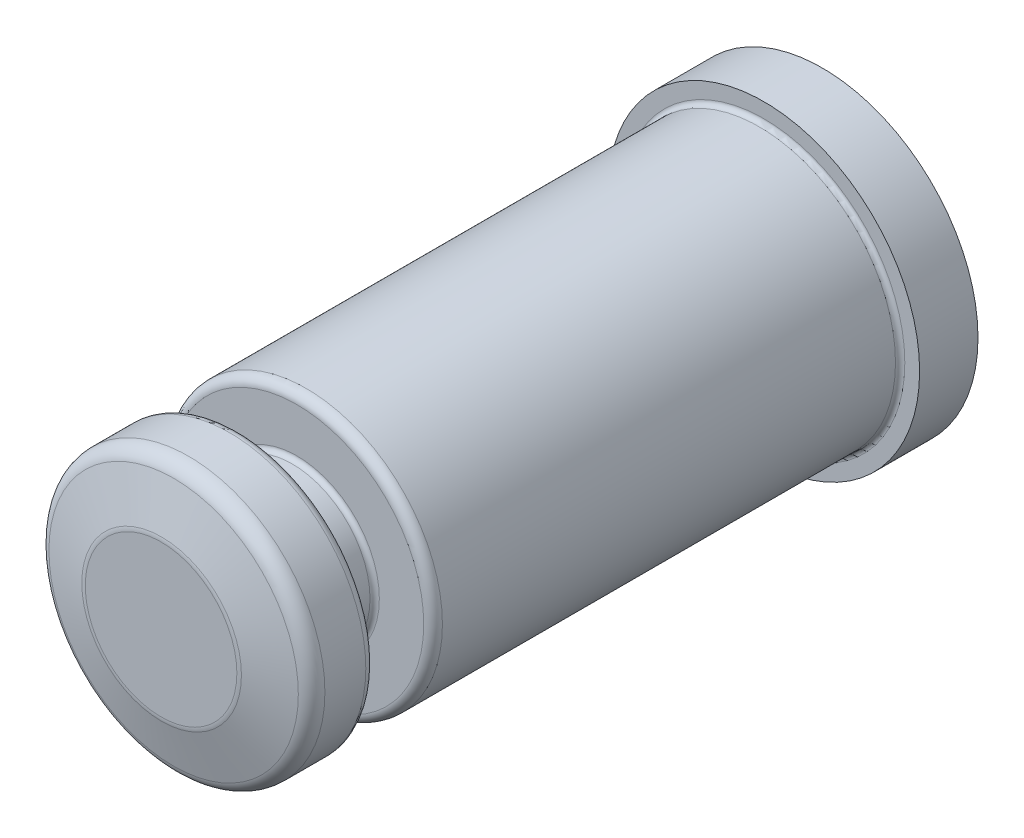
ISO-10303-21;
HEADER;
FILE_DESCRIPTION(('STEP AP214'),'2;1');
FILE_NAME('part.step','',(''),(''),'','','');
FILE_SCHEMA(('AUTOMOTIVE_DESIGN { 1 0 10303 214 1 1 1 1 }'));
ENDSEC;
DATA;
#1=APPLICATION_CONTEXT('core data for automotive mechanical design processes');
#2=APPLICATION_PROTOCOL_DEFINITION('international standard','automotive_design',2000,#1);
#3=PRODUCT_CONTEXT('',#1,'mechanical');
#4=PRODUCT('Part','Part','',(#3));
#5=PRODUCT_RELATED_PRODUCT_CATEGORY('part','',(#4));
#6=PRODUCT_DEFINITION_FORMATION('','',#4);
#7=PRODUCT_DEFINITION_CONTEXT('part definition',#1,'design');
#8=PRODUCT_DEFINITION('design','',#6,#7);
#9=PRODUCT_DEFINITION_SHAPE('','',#8);
#10=(LENGTH_UNIT() NAMED_UNIT(*) SI_UNIT(.MILLI.,.METRE.));
#11=(NAMED_UNIT(*) PLANE_ANGLE_UNIT() SI_UNIT($,.RADIAN.));
#12=(NAMED_UNIT(*) SI_UNIT($,.STERADIAN.) SOLID_ANGLE_UNIT());
#13=UNCERTAINTY_MEASURE_WITH_UNIT(LENGTH_MEASURE(1.E-05),#10,'distance_accuracy_value','');
#14=(GEOMETRIC_REPRESENTATION_CONTEXT(3) GLOBAL_UNCERTAINTY_ASSIGNED_CONTEXT((#13)) GLOBAL_UNIT_ASSIGNED_CONTEXT((#10,
#11,#12)) REPRESENTATION_CONTEXT('',''));
#15=CARTESIAN_POINT('',(0.,0.,0.));
#16=DIRECTION('',(0.,0.,1.));
#17=DIRECTION('',(1.,0.,0.));
#18=AXIS2_PLACEMENT_3D('',#15,#16,#17);
#19=CARTESIAN_POINT('',(0.,0.,-42.8624999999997));
#20=DIRECTION('',(0.,0.,-0.999999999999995));
#21=DIRECTION('',(-1.,0.,0.));
#22=AXIS2_PLACEMENT_3D('',#19,#20,#21);
#23=PLANE('',#22);
#24=CARTESIAN_POINT('',(0.,0.,-42.8624999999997));
#25=DIRECTION('',(0.,0.,0.999999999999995));
#26=DIRECTION('',(1.,0.,0.));
#27=AXIS2_PLACEMENT_3D('',#24,#25,#26);
#28=CIRCLE('',#27,12.7);
#29=CARTESIAN_POINT('',(12.7,0.,-42.8624999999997));
#30=VERTEX_POINT('',#29);
#31=EDGE_CURVE('E10',#30,#30,#28,.T.);
#32=ORIENTED_EDGE('',*,*,#31,.F.);
#33=EDGE_LOOP('',(#32));
#34=FACE_BOUND('',#33,.T.);
#35=ADVANCED_FACE('F39',(#34),#23,.T.);
#36=CARTESIAN_POINT('',(0.,0.,16.2761575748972));
#37=DIRECTION('',(0.,0.,0.999999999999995));
#38=DIRECTION('',(1.,0.,0.));
#39=AXIS2_PLACEMENT_3D('',#36,#37,#38);
#40=CYLINDRICAL_SURFACE('',#39,12.7);
#41=CARTESIAN_POINT('',(0.,0.,-38.0999999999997));
#42=DIRECTION('',(0.,0.,0.999999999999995));
#43=DIRECTION('',(1.,0.,0.));
#44=AXIS2_PLACEMENT_3D('',#41,#42,#43);
#45=CIRCLE('',#44,12.7);
#46=CARTESIAN_POINT('',(12.7,0.,-38.0999999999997));
#47=VERTEX_POINT('',#46);
#48=EDGE_CURVE('E46',#47,#47,#45,.T.);
#49=CARTESIAN_POINT('',(12.7,0.,-42.8624999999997));
#50=CARTESIAN_POINT('',(12.7,0.,-42.8128906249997));
#51=CARTESIAN_POINT('',(12.7,0.,-42.7632812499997));
#52=CARTESIAN_POINT('',(12.7,0.,-42.6640624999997));
#53=CARTESIAN_POINT('',(12.7,0.,-42.6144531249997));
#54=CARTESIAN_POINT('',(12.7,0.,-42.5152343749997));
#55=CARTESIAN_POINT('',(12.7,0.,-42.4656249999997));
#56=CARTESIAN_POINT('',(12.7,0.,-42.3664062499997));
#57=CARTESIAN_POINT('',(12.7,0.,-42.3167968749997));
#58=CARTESIAN_POINT('',(12.7,0.,-42.2175781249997));
#59=CARTESIAN_POINT('',(12.7,0.,-42.1679687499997));
#60=CARTESIAN_POINT('',(12.7,0.,-42.0687499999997));
#61=CARTESIAN_POINT('',(12.7,0.,-42.0191406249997));
#62=CARTESIAN_POINT('',(12.7,0.,-41.9199218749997));
#63=CARTESIAN_POINT('',(12.7,0.,-41.8703124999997));
#64=CARTESIAN_POINT('',(12.7,0.,-41.7710937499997));
#65=CARTESIAN_POINT('',(12.7,0.,-41.7214843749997));
#66=CARTESIAN_POINT('',(12.7,0.,-41.6222656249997));
#67=CARTESIAN_POINT('',(12.7,0.,-41.5726562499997));
#68=CARTESIAN_POINT('',(12.7,0.,-41.4734374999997));
#69=CARTESIAN_POINT('',(12.7,0.,-41.4238281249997));
#70=CARTESIAN_POINT('',(12.7,0.,-41.3246093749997));
#71=CARTESIAN_POINT('',(12.7,0.,-41.2749999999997));
#72=CARTESIAN_POINT('',(12.7,0.,-41.1757812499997));
#73=CARTESIAN_POINT('',(12.7,0.,-41.1261718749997));
#74=CARTESIAN_POINT('',(12.7,0.,-41.0269531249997));
#75=CARTESIAN_POINT('',(12.7,0.,-40.9773437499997));
#76=CARTESIAN_POINT('',(12.7,0.,-40.8781249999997));
#77=CARTESIAN_POINT('',(12.7,0.,-40.8285156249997));
#78=CARTESIAN_POINT('',(12.7,0.,-40.7292968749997));
#79=CARTESIAN_POINT('',(12.7,0.,-40.6796874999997));
#80=CARTESIAN_POINT('',(12.7,0.,-40.5804687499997));
#81=CARTESIAN_POINT('',(12.7,0.,-40.5308593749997));
#82=CARTESIAN_POINT('',(12.7,0.,-40.4316406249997));
#83=CARTESIAN_POINT('',(12.7,0.,-40.3820312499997));
#84=CARTESIAN_POINT('',(12.7,0.,-40.2828124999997));
#85=CARTESIAN_POINT('',(12.7,0.,-40.2332031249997));
#86=CARTESIAN_POINT('',(12.7,0.,-40.1339843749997));
#87=CARTESIAN_POINT('',(12.7,0.,-40.0843749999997));
#88=CARTESIAN_POINT('',(12.7,0.,-39.9851562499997));
#89=CARTESIAN_POINT('',(12.7,0.,-39.9355468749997));
#90=CARTESIAN_POINT('',(12.7,0.,-39.8363281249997));
#91=CARTESIAN_POINT('',(12.7,0.,-39.7867187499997));
#92=CARTESIAN_POINT('',(12.7,0.,-39.6874999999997));
#93=CARTESIAN_POINT('',(12.7,0.,-39.6378906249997));
#94=CARTESIAN_POINT('',(12.7,0.,-39.5386718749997));
#95=CARTESIAN_POINT('',(12.7,0.,-39.4890624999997));
#96=CARTESIAN_POINT('',(12.7,0.,-39.3898437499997));
#97=CARTESIAN_POINT('',(12.7,0.,-39.3402343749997));
#98=CARTESIAN_POINT('',(12.7,0.,-39.2410156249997));
#99=CARTESIAN_POINT('',(12.7,0.,-39.1914062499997));
#100=CARTESIAN_POINT('',(12.7,0.,-39.0921874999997));
#101=CARTESIAN_POINT('',(12.7,0.,-39.0425781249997));
#102=CARTESIAN_POINT('',(12.7,0.,-38.9433593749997));
#103=CARTESIAN_POINT('',(12.7,0.,-38.8937499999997));
#104=CARTESIAN_POINT('',(12.7,0.,-38.7945312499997));
#105=CARTESIAN_POINT('',(12.7,0.,-38.7449218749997));
#106=CARTESIAN_POINT('',(12.7,0.,-38.6457031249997));
#107=CARTESIAN_POINT('',(12.7,0.,-38.5960937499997));
#108=CARTESIAN_POINT('',(12.7,0.,-38.4968749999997));
#109=CARTESIAN_POINT('',(12.7,0.,-38.4472656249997));
#110=CARTESIAN_POINT('',(12.7,0.,-38.3480468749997));
#111=CARTESIAN_POINT('',(12.7,0.,-38.2984374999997));
#112=CARTESIAN_POINT('',(12.7,0.,-38.1992187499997));
#113=CARTESIAN_POINT('',(12.7,0.,-38.1496093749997));
#114=CARTESIAN_POINT('',(12.7,0.,-38.0999999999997));
#115=B_SPLINE_CURVE_WITH_KNOTS('',3,(#49,#50,#51,#52,#53,#54,#55,#56,#57,#58,#59,#60,#61,#62,
#63,#64,#65,#66,#67,#68,#69,#70,#71,#72,#73,#74,#75,#76,#77,#78,#79,#80,#81,#82,#83,#84,#85,#86,
#87,#88,#89,#90,#91,#92,#93,#94,#95,#96,#97,#98,#99,#100,#101,#102,#103,#104,#105,#106,#107,
#108,#109,#110,#111,#112,#113,#114),.UNSPECIFIED.,.F.,.F.,(4,2,2,2,2,2,2,2,2,2,2,2,2,2,2,2,2,2,
2,2,2,2,2,2,2,2,2,2,2,2,2,2,4),(0.,0.148828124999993,0.297656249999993,0.446484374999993,
0.595312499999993,0.744140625,0.892968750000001,1.041796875,1.190625,1.339453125,
1.48828124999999,1.63710937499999,1.7859375,1.934765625,2.08359375,2.232421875,2.38125,
2.530078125,2.67890625,2.82773437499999,2.97656249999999,3.125390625,3.27421875,3.423046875,
3.571875,3.720703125,3.86953125,4.018359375,4.1671875,4.316015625,4.46484375,4.613671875,
4.7625),.UNSPECIFIED.);
#116=EDGE_CURVE('BSEAM130',#30,#47,#115,.T.);
#117=ORIENTED_EDGE('',*,*,#31,.T.);
#118=ORIENTED_EDGE('',*,*,#48,.F.);
#119=ORIENTED_EDGE('',*,*,#116,.T.);
#120=ORIENTED_EDGE('',*,*,#116,.F.);
#121=EDGE_LOOP('',(#117,#119,#118,#120));
#122=FACE_BOUND('',#121,.T.);
#123=ADVANCED_FACE('F130',(#122),#40,.T.);
#124=CARTESIAN_POINT('',(-12.6999999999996,0.,-38.0999999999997));
#125=DIRECTION('',(0.,0.,0.999999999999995));
#126=DIRECTION('',(1.,0.,0.));
#127=AXIS2_PLACEMENT_3D('',#124,#125,#126);
#128=PLANE('',#127);
#129=ORIENTED_EDGE('',*,*,#48,.T.);
#130=EDGE_LOOP('',(#129));
#131=FACE_BOUND('',#130,.T.);
#132=CARTESIAN_POINT('',(0.,0.,-38.0999999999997));
#133=DIRECTION('',(0.,0.,0.999999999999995));
#134=DIRECTION('',(1.,0.,0.));
#135=AXIS2_PLACEMENT_3D('',#132,#133,#134);
#136=CIRCLE('',#135,11.4935);
#137=CARTESIAN_POINT('',(11.4935,0.,-38.0999999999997));
#138=VERTEX_POINT('',#137);
#139=EDGE_CURVE('E52',#138,#138,#136,.T.);
#140=ORIENTED_EDGE('',*,*,#139,.F.);
#141=EDGE_LOOP('',(#140));
#142=FACE_BOUND('',#141,.T.);
#143=ADVANCED_FACE('F135',(#131,#142),#128,.T.);
#144=CARTESIAN_POINT('',(0.,0.,-37.7189999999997));
#145=DIRECTION('',(0.,0.,0.999999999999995));
#146=DIRECTION('',(1.,0.,0.));
#147=AXIS2_PLACEMENT_3D('',#144,#145,#146);
#148=TOROIDAL_SURFACE('',#147,11.4935,0.380999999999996);
#149=ORIENTED_EDGE('',*,*,#139,.T.);
#150=EDGE_LOOP('',(#149));
#151=FACE_BOUND('',#150,.T.);
#152=CARTESIAN_POINT('',(0.,0.,-37.7189999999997));
#153=DIRECTION('',(0.,0.,0.999999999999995));
#154=DIRECTION('',(1.,0.,0.));
#155=AXIS2_PLACEMENT_3D('',#152,#153,#154);
#156=CIRCLE('',#155,11.1125);
#157=CARTESIAN_POINT('',(11.1125,0.,-37.7189999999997));
#158=VERTEX_POINT('',#157);
#159=EDGE_CURVE('E58',#158,#158,#156,.T.);
#160=ORIENTED_EDGE('',*,*,#159,.F.);
#161=EDGE_LOOP('',(#160));
#162=FACE_BOUND('',#161,.T.);
#163=ADVANCED_FACE('F139',(#151,#162),#148,.F.);
#164=CARTESIAN_POINT('',(0.,0.,16.2761575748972));
#165=DIRECTION('',(0.,0.,0.999999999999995));
#166=DIRECTION('',(1.,0.,0.));
#167=AXIS2_PLACEMENT_3D('',#164,#165,#166);
#168=CYLINDRICAL_SURFACE('',#167,11.1125);
#169=CARTESIAN_POINT('',(0.,0.,-0.761999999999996));
#170=DIRECTION('',(0.,0.,0.999999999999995));
#171=DIRECTION('',(1.,0.,0.));
#172=AXIS2_PLACEMENT_3D('',#169,#170,#171);
#173=CIRCLE('',#172,11.1125);
#174=CARTESIAN_POINT('',(11.1125,0.,-0.761999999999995));
#175=VERTEX_POINT('',#174);
#176=EDGE_CURVE('E64',#175,#175,#173,.T.);
#177=CARTESIAN_POINT('',(11.1125,0.,-37.7189999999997));
#178=CARTESIAN_POINT('',(11.1125,0.,-37.3340312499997));
#179=CARTESIAN_POINT('',(11.1125,0.,-36.9490624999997));
#180=CARTESIAN_POINT('',(11.1125,0.,-36.1791249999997));
#181=CARTESIAN_POINT('',(11.1125,0.,-35.7941562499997));
#182=CARTESIAN_POINT('',(11.1125,0.,-35.0242187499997));
#183=CARTESIAN_POINT('',(11.1125,0.,-34.6392499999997));
#184=CARTESIAN_POINT('',(11.1125,0.,-33.8693124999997));
#185=CARTESIAN_POINT('',(11.1125,0.,-33.4843437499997));
#186=CARTESIAN_POINT('',(11.1125,0.,-32.7144062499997));
#187=CARTESIAN_POINT('',(11.1125,0.,-32.3294374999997));
#188=CARTESIAN_POINT('',(11.1125,0.,-31.5594999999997));
#189=CARTESIAN_POINT('',(11.1125,0.,-31.1745312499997));
#190=CARTESIAN_POINT('',(11.1125,0.,-30.4045937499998));
#191=CARTESIAN_POINT('',(11.1125,0.,-30.0196249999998));
#192=CARTESIAN_POINT('',(11.1125,0.,-29.2496874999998));
#193=CARTESIAN_POINT('',(11.1125,0.,-28.8647187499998));
#194=CARTESIAN_POINT('',(11.1125,0.,-28.0947812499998));
#195=CARTESIAN_POINT('',(11.1125,0.,-27.7098124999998));
#196=CARTESIAN_POINT('',(11.1125,0.,-26.9398749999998));
#197=CARTESIAN_POINT('',(11.1125,0.,-26.5549062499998));
#198=CARTESIAN_POINT('',(11.1125,0.,-25.7849687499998));
#199=CARTESIAN_POINT('',(11.1125,0.,-25.3999999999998));
#200=CARTESIAN_POINT('',(11.1125,0.,-24.6300624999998));
#201=CARTESIAN_POINT('',(11.1125,0.,-24.2450937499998));
#202=CARTESIAN_POINT('',(11.1125,0.,-23.4751562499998));
#203=CARTESIAN_POINT('',(11.1125,0.,-23.0901874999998));
#204=CARTESIAN_POINT('',(11.1125,0.,-22.3202499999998));
#205=CARTESIAN_POINT('',(11.1125,0.,-21.9352812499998));
#206=CARTESIAN_POINT('',(11.1125,0.,-21.1653437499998));
#207=CARTESIAN_POINT('',(11.1125,0.,-20.7803749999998));
#208=CARTESIAN_POINT('',(11.1125,0.,-20.0104374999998));
#209=CARTESIAN_POINT('',(11.1125,0.,-19.6254687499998));
#210=CARTESIAN_POINT('',(11.1125,0.,-18.8555312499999));
#211=CARTESIAN_POINT('',(11.1125,0.,-18.4705624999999));
#212=CARTESIAN_POINT('',(11.1125,0.,-17.7006249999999));
#213=CARTESIAN_POINT('',(11.1125,0.,-17.3156562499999));
#214=CARTESIAN_POINT('',(11.1125,0.,-16.5457187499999));
#215=CARTESIAN_POINT('',(11.1125,0.,-16.1607499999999));
#216=CARTESIAN_POINT('',(11.1125,0.,-15.3908124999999));
#217=CARTESIAN_POINT('',(11.1125,0.,-15.0058437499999));
#218=CARTESIAN_POINT('',(11.1125,0.,-14.2359062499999));
#219=CARTESIAN_POINT('',(11.1125,0.,-13.8509374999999));
#220=CARTESIAN_POINT('',(11.1125,0.,-13.0809999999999));
#221=CARTESIAN_POINT('',(11.1125,0.,-12.6960312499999));
#222=CARTESIAN_POINT('',(11.1125,0.,-11.9260937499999));
#223=CARTESIAN_POINT('',(11.1125,0.,-11.5411249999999));
#224=CARTESIAN_POINT('',(11.1125,0.,-10.7711874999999));
#225=CARTESIAN_POINT('',(11.1125,0.,-10.3862187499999));
#226=CARTESIAN_POINT('',(11.1125,0.,-9.61628124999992));
#227=CARTESIAN_POINT('',(11.1125,0.,-9.23131249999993));
#228=CARTESIAN_POINT('',(11.1125,0.,-8.46137499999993));
#229=CARTESIAN_POINT('',(11.1125,0.,-8.07640624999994));
#230=CARTESIAN_POINT('',(11.1125,0.,-7.30646874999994));
#231=CARTESIAN_POINT('',(11.1125,0.,-6.92149999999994));
#232=CARTESIAN_POINT('',(11.1125,0.,-6.15156249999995));
#233=CARTESIAN_POINT('',(11.1125,0.,-5.76659374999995));
#234=CARTESIAN_POINT('',(11.1125,0.,-4.99665624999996));
#235=CARTESIAN_POINT('',(11.1125,0.,-4.61168749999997));
#236=CARTESIAN_POINT('',(11.1125,0.,-3.84174999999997));
#237=CARTESIAN_POINT('',(11.1125,0.,-3.45678124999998));
#238=CARTESIAN_POINT('',(11.1125,0.,-2.68684374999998));
#239=CARTESIAN_POINT('',(11.1125,0.,-2.30187499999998));
#240=CARTESIAN_POINT('',(11.1125,0.,-1.53193749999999));
#241=CARTESIAN_POINT('',(11.1125,0.,-1.14696874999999));
#242=CARTESIAN_POINT('',(11.1125,0.,-0.761999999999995));
#243=B_SPLINE_CURVE_WITH_KNOTS('',3,(#177,#178,#179,#180,#181,#182,#183,#184,#185,#186,#187,
#188,#189,#190,#191,#192,#193,#194,#195,#196,#197,#198,#199,#200,#201,#202,#203,#204,#205,#206,
#207,#208,#209,#210,#211,#212,#213,#214,#215,#216,#217,#218,#219,#220,#221,#222,#223,#224,#225,
#226,#227,#228,#229,#230,#231,#232,#233,#234,#235,#236,#237,#238,#239,#240,#241,#242),
.UNSPECIFIED.,.F.,.F.,(4,2,2,2,2,2,2,2,2,2,2,2,2,2,2,2,2,2,2,2,2,2,2,2,2,2,2,2,2,2,2,2,4),(0.,
1.15490624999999,2.30981249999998,3.46471874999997,4.61962499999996,5.77453124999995,
6.92943749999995,8.08434374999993,9.23924999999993,10.3941562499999,11.5490624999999,
12.7039687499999,13.8588749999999,15.0137812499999,16.1686874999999,17.3235937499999,
18.4784999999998,19.6334062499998,20.7883124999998,21.9432187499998,23.0981249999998,
24.2530312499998,25.4079374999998,26.5628437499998,27.7177499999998,28.8726562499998,
30.0275624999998,31.1824687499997,32.3373749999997,33.4922812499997,34.6471874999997,
35.8020937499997,36.9569999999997),.UNSPECIFIED.);
#244=EDGE_CURVE('BSEAM145',#158,#175,#243,.T.);
#245=ORIENTED_EDGE('',*,*,#159,.T.);
#246=ORIENTED_EDGE('',*,*,#176,.F.);
#247=ORIENTED_EDGE('',*,*,#244,.T.);
#248=ORIENTED_EDGE('',*,*,#244,.F.);
#249=EDGE_LOOP('',(#245,#247,#246,#248));
#250=FACE_BOUND('',#249,.T.);
#251=ADVANCED_FACE('F145',(#250),#168,.T.);
#252=CARTESIAN_POINT('',(0.,0.,-0.761999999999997));
#253=DIRECTION('',(0.,0.,0.999999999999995));
#254=DIRECTION('',(1.,0.,0.));
#255=AXIS2_PLACEMENT_3D('',#252,#253,#254);
#256=TOROIDAL_SURFACE('',#255,10.3505,0.761999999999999);
#257=ORIENTED_EDGE('',*,*,#176,.T.);
#258=EDGE_LOOP('',(#257));
#259=FACE_BOUND('',#258,.T.);
#260=CARTESIAN_POINT('',(0.,0.,0.));
#261=DIRECTION('',(0.,0.,0.999999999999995));
#262=DIRECTION('',(1.,0.,0.));
#263=AXIS2_PLACEMENT_3D('',#260,#261,#262);
#264=CIRCLE('',#263,10.3505);
#265=CARTESIAN_POINT('',(10.3505,0.,0.));
#266=VERTEX_POINT('',#265);
#267=EDGE_CURVE('E68',#266,#266,#264,.T.);
#268=ORIENTED_EDGE('',*,*,#267,.F.);
#269=EDGE_LOOP('',(#268));
#270=FACE_BOUND('',#269,.T.);
#271=ADVANCED_FACE('F149',(#259,#270),#256,.T.);
#272=CARTESIAN_POINT('',(-10.3504999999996,2.22044604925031E-13,0.));
#273=DIRECTION('',(0.,0.,0.999999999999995));
#274=DIRECTION('',(1.,0.,0.));
#275=AXIS2_PLACEMENT_3D('',#272,#273,#274);
#276=PLANE('',#275);
#277=ORIENTED_EDGE('',*,*,#267,.T.);
#278=EDGE_LOOP('',(#277));
#279=FACE_BOUND('',#278,.T.);
#280=CARTESIAN_POINT('',(0.,0.,0.));
#281=DIRECTION('',(0.,0.,0.999999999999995));
#282=DIRECTION('',(1.,0.,0.));
#283=AXIS2_PLACEMENT_3D('',#280,#281,#282);
#284=CIRCLE('',#283,6.73099999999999);
#285=CARTESIAN_POINT('',(6.731,0.,0.));
#286=VERTEX_POINT('',#285);
#287=EDGE_CURVE('E72',#286,#286,#284,.T.);
#288=ORIENTED_EDGE('',*,*,#287,.F.);
#289=EDGE_LOOP('',(#288));
#290=FACE_BOUND('',#289,.T.);
#291=ADVANCED_FACE('F153',(#279,#290),#276,.T.);
#292=CARTESIAN_POINT('',(0.,0.,0.380999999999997));
#293=DIRECTION('',(0.,0.,0.999999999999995));
#294=DIRECTION('',(1.,0.,0.));
#295=AXIS2_PLACEMENT_3D('',#292,#293,#294);
#296=TOROIDAL_SURFACE('',#295,6.73099999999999,0.381);
#297=ORIENTED_EDGE('',*,*,#287,.T.);
#298=EDGE_LOOP('',(#297));
#299=FACE_BOUND('',#298,.T.);
#300=CARTESIAN_POINT('',(0.,0.,0.380999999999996));
#301=DIRECTION('',(0.,0.,0.999999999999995));
#302=DIRECTION('',(1.,0.,0.));
#303=AXIS2_PLACEMENT_3D('',#300,#301,#302);
#304=CIRCLE('',#303,6.34999999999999);
#305=CARTESIAN_POINT('',(6.35,0.,0.380999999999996));
#306=VERTEX_POINT('',#305);
#307=EDGE_CURVE('E76',#306,#306,#304,.T.);
#308=ORIENTED_EDGE('',*,*,#307,.F.);
#309=EDGE_LOOP('',(#308));
#310=FACE_BOUND('',#309,.T.);
#311=ADVANCED_FACE('F157',(#299,#310),#296,.F.);
#312=CARTESIAN_POINT('',(0.,0.,16.2761575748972));
#313=DIRECTION('',(0.,0.,0.999999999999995));
#314=DIRECTION('',(1.,0.,0.));
#315=AXIS2_PLACEMENT_3D('',#312,#313,#314);
#316=CYLINDRICAL_SURFACE('',#315,6.34999999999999);
#317=CARTESIAN_POINT('',(0.,0.,4.34339999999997));
#318=DIRECTION('',(0.,0.,0.999999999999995));
#319=DIRECTION('',(1.,0.,0.));
#320=AXIS2_PLACEMENT_3D('',#317,#318,#319);
#321=CIRCLE('',#320,6.34999999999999);
#322=CARTESIAN_POINT('',(6.35,0.,4.34339999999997));
#323=VERTEX_POINT('',#322);
#324=EDGE_CURVE('E80',#323,#323,#321,.T.);
#325=CARTESIAN_POINT('',(6.35,0.,0.380999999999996));
#326=CARTESIAN_POINT('',(6.35,0.,0.422274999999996));
#327=CARTESIAN_POINT('',(6.35,0.,0.463549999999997));
#328=CARTESIAN_POINT('',(6.35,0.,0.546099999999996));
#329=CARTESIAN_POINT('',(6.35,0.,0.587374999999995));
#330=CARTESIAN_POINT('',(6.35,0.,0.669924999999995));
#331=CARTESIAN_POINT('',(6.35,0.,0.711199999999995));
#332=CARTESIAN_POINT('',(6.35,0.,0.793749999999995));
#333=CARTESIAN_POINT('',(6.35,0.,0.835024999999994));
#334=CARTESIAN_POINT('',(6.35,0.,0.917574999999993));
#335=CARTESIAN_POINT('',(6.35,0.,0.958849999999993));
#336=CARTESIAN_POINT('',(6.35,0.,1.04139999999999));
#337=CARTESIAN_POINT('',(6.35,0.,1.08267499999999));
#338=CARTESIAN_POINT('',(6.35,0.,1.16522499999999));
#339=CARTESIAN_POINT('',(6.35,0.,1.20649999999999));
#340=CARTESIAN_POINT('',(6.35,0.,1.28904999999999));
#341=CARTESIAN_POINT('',(6.35,0.,1.33032499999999));
#342=CARTESIAN_POINT('',(6.35,0.,1.41287499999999));
#343=CARTESIAN_POINT('',(6.35,0.,1.45414999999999));
#344=CARTESIAN_POINT('',(6.35,0.,1.53669999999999));
#345=CARTESIAN_POINT('',(6.35,0.,1.57797499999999));
#346=CARTESIAN_POINT('',(6.35,0.,1.66052499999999));
#347=CARTESIAN_POINT('',(6.35,0.,1.70179999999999));
#348=CARTESIAN_POINT('',(6.35,0.,1.78434999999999));
#349=CARTESIAN_POINT('',(6.35,0.,1.82562499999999));
#350=CARTESIAN_POINT('',(6.35,0.,1.90817499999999));
#351=CARTESIAN_POINT('',(6.35,0.,1.94944999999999));
#352=CARTESIAN_POINT('',(6.35,0.,2.03199999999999));
#353=CARTESIAN_POINT('',(6.35,0.,2.07327499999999));
#354=CARTESIAN_POINT('',(6.35,0.,2.15582499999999));
#355=CARTESIAN_POINT('',(6.35,0.,2.19709999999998));
#356=CARTESIAN_POINT('',(6.35,0.,2.27964999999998));
#357=CARTESIAN_POINT('',(6.35,0.,2.32092499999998));
#358=CARTESIAN_POINT('',(6.35,0.,2.40347499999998));
#359=CARTESIAN_POINT('',(6.35,0.,2.44474999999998));
#360=CARTESIAN_POINT('',(6.35,0.,2.52729999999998));
#361=CARTESIAN_POINT('',(6.35,0.,2.56857499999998));
#362=CARTESIAN_POINT('',(6.35,0.,2.65112499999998));
#363=CARTESIAN_POINT('',(6.35,0.,2.69239999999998));
#364=CARTESIAN_POINT('',(6.35,0.,2.77494999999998));
#365=CARTESIAN_POINT('',(6.35,0.,2.81622499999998));
#366=CARTESIAN_POINT('',(6.35,0.,2.89877499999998));
#367=CARTESIAN_POINT('',(6.35,0.,2.94004999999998));
#368=CARTESIAN_POINT('',(6.35,0.,3.02259999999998));
#369=CARTESIAN_POINT('',(6.35,0.,3.06387499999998));
#370=CARTESIAN_POINT('',(6.35,0.,3.14642499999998));
#371=CARTESIAN_POINT('',(6.35,0.,3.18769999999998));
#372=CARTESIAN_POINT('',(6.35,0.,3.27024999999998));
#373=CARTESIAN_POINT('',(6.35,0.,3.31152499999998));
#374=CARTESIAN_POINT('',(6.35,0.,3.39407499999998));
#375=CARTESIAN_POINT('',(6.35,0.,3.43534999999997));
#376=CARTESIAN_POINT('',(6.35,0.,3.51789999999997));
#377=CARTESIAN_POINT('',(6.35,0.,3.55917499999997));
#378=CARTESIAN_POINT('',(6.35,0.,3.64172499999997));
#379=CARTESIAN_POINT('',(6.35,0.,3.68299999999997));
#380=CARTESIAN_POINT('',(6.35,0.,3.76554999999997));
#381=CARTESIAN_POINT('',(6.35,0.,3.80682499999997));
#382=CARTESIAN_POINT('',(6.35,0.,3.88937499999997));
#383=CARTESIAN_POINT('',(6.35,0.,3.93064999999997));
#384=CARTESIAN_POINT('',(6.35,0.,4.01319999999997));
#385=CARTESIAN_POINT('',(6.35,0.,4.05447499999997));
#386=CARTESIAN_POINT('',(6.35,0.,4.13702499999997));
#387=CARTESIAN_POINT('',(6.35,0.,4.17829999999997));
#388=CARTESIAN_POINT('',(6.35,0.,4.26084999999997));
#389=CARTESIAN_POINT('',(6.35,0.,4.30212499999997));
#390=CARTESIAN_POINT('',(6.35,0.,4.34339999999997));
#391=B_SPLINE_CURVE_WITH_KNOTS('',3,(#325,#326,#327,#328,#329,#330,#331,#332,#333,#334,#335,
#336,#337,#338,#339,#340,#341,#342,#343,#344,#345,#346,#347,#348,#349,#350,#351,#352,#353,#354,
#355,#356,#357,#358,#359,#360,#361,#362,#363,#364,#365,#366,#367,#368,#369,#370,#371,#372,#373,
#374,#375,#376,#377,#378,#379,#380,#381,#382,#383,#384,#385,#386,#387,#388,#389,#390),
.UNSPECIFIED.,.F.,.F.,(4,2,2,2,2,2,2,2,2,2,2,2,2,2,2,2,2,2,2,2,2,2,2,2,2,2,2,2,2,2,2,2,4),(0.,
0.123825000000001,0.247649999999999,0.371475,0.495299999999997,0.619124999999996,
0.742949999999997,0.866774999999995,0.990599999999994,1.11442499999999,1.23824999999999,
1.36207499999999,1.48589999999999,1.60972499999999,1.73354999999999,1.85737499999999,
1.98119999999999,2.10502499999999,2.22884999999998,2.35267499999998,2.47649999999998,
2.60032499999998,2.72414999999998,2.84797499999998,2.97179999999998,3.09562499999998,
3.21944999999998,3.34327499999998,3.46709999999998,3.59092499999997,3.71474999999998,
3.83857499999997,3.96239999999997),.UNSPECIFIED.);
#392=EDGE_CURVE('BSEAM161',#306,#323,#391,.T.);
#393=ORIENTED_EDGE('',*,*,#307,.T.);
#394=ORIENTED_EDGE('',*,*,#324,.F.);
#395=ORIENTED_EDGE('',*,*,#392,.T.);
#396=ORIENTED_EDGE('',*,*,#392,.F.);
#397=EDGE_LOOP('',(#393,#395,#394,#396));
#398=FACE_BOUND('',#397,.T.);
#399=ADVANCED_FACE('F161',(#398),#316,.T.);
#400=CARTESIAN_POINT('',(0.,0.,4.34339999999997));
#401=DIRECTION('',(0.,0.,0.999999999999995));
#402=DIRECTION('',(1.,0.,0.));
#403=AXIS2_PLACEMENT_3D('',#400,#401,#402);
#404=TOROIDAL_SURFACE('',#403,6.73099999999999,0.381);
#405=ORIENTED_EDGE('',*,*,#324,.T.);
#406=EDGE_LOOP('',(#405));
#407=FACE_BOUND('',#406,.T.);
#408=CARTESIAN_POINT('',(0.,0.,4.72439999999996));
#409=DIRECTION('',(0.,0.,0.999999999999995));
#410=DIRECTION('',(1.,0.,0.));
#411=AXIS2_PLACEMENT_3D('',#408,#409,#410);
#412=CIRCLE('',#411,6.73099999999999);
#413=CARTESIAN_POINT('',(6.731,0.,4.72439999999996));
#414=VERTEX_POINT('',#413);
#415=EDGE_CURVE('E84',#414,#414,#412,.T.);
#416=ORIENTED_EDGE('',*,*,#415,.F.);
#417=EDGE_LOOP('',(#416));
#418=FACE_BOUND('',#417,.T.);
#419=ADVANCED_FACE('F165',(#407,#418),#404,.F.);
#420=CARTESIAN_POINT('',(-6.73099999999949,0.,4.72439999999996));
#421=DIRECTION('',(0.,0.,-0.999999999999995));
#422=DIRECTION('',(-1.,0.,0.));
#423=AXIS2_PLACEMENT_3D('',#420,#421,#422);
#424=PLANE('',#423);
#425=ORIENTED_EDGE('',*,*,#415,.T.);
#426=EDGE_LOOP('',(#425));
#427=FACE_BOUND('',#426,.T.);
#428=CARTESIAN_POINT('',(0.,0.,4.72439999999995));
#429=DIRECTION('',(0.,0.,0.999999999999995));
#430=DIRECTION('',(1.,0.,0.));
#431=AXIS2_PLACEMENT_3D('',#428,#429,#430);
#432=CIRCLE('',#431,10.3505);
#433=CARTESIAN_POINT('',(10.3505,0.,4.72439999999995));
#434=VERTEX_POINT('',#433);
#435=EDGE_CURVE('E88',#434,#434,#432,.T.);
#436=ORIENTED_EDGE('',*,*,#435,.F.);
#437=EDGE_LOOP('',(#436));
#438=FACE_BOUND('',#437,.T.);
#439=ADVANCED_FACE('F169',(#427,#438),#424,.T.);
#440=CARTESIAN_POINT('',(0.,0.,5.48639999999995));
#441=DIRECTION('',(0.,0.,0.999999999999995));
#442=DIRECTION('',(1.,0.,0.));
#443=AXIS2_PLACEMENT_3D('',#440,#441,#442);
#444=TOROIDAL_SURFACE('',#443,10.3505,0.762);
#445=ORIENTED_EDGE('',*,*,#435,.T.);
#446=EDGE_LOOP('',(#445));
#447=FACE_BOUND('',#446,.T.);
#448=CARTESIAN_POINT('',(0.,0.,5.48639999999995));
#449=DIRECTION('',(0.,0.,0.999999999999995));
#450=DIRECTION('',(1.,0.,0.));
#451=AXIS2_PLACEMENT_3D('',#448,#449,#450);
#452=CIRCLE('',#451,11.1125);
#453=CARTESIAN_POINT('',(11.1125,0.,5.48639999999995));
#454=VERTEX_POINT('',#453);
#455=EDGE_CURVE('E92',#454,#454,#452,.T.);
#456=ORIENTED_EDGE('',*,*,#455,.F.);
#457=EDGE_LOOP('',(#456));
#458=FACE_BOUND('',#457,.T.);
#459=ADVANCED_FACE('F173',(#447,#458),#444,.T.);
#460=CARTESIAN_POINT('',(0.,0.,16.2761575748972));
#461=DIRECTION('',(0.,0.,0.999999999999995));
#462=DIRECTION('',(1.,0.,0.));
#463=AXIS2_PLACEMENT_3D('',#460,#461,#462);
#464=CYLINDRICAL_SURFACE('',#463,11.1125);
#465=CARTESIAN_POINT('',(0.,0.,8.82378669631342));
#466=DIRECTION('',(0.,0.,0.999999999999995));
#467=DIRECTION('',(1.,0.,0.));
#468=AXIS2_PLACEMENT_3D('',#465,#466,#467);
#469=CIRCLE('',#468,11.1125);
#470=CARTESIAN_POINT('',(11.1125,0.,8.82378669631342));
#471=VERTEX_POINT('',#470);
#472=EDGE_CURVE('E96',#471,#471,#469,.T.);
#473=CARTESIAN_POINT('',(11.1125,0.,5.48639999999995));
#474=CARTESIAN_POINT('',(11.1125,0.,5.52116444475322));
#475=CARTESIAN_POINT('',(11.1125,0.,5.55592888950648));
#476=CARTESIAN_POINT('',(11.1125,0.,5.62545777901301));
#477=CARTESIAN_POINT('',(11.1125,0.,5.66022222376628));
#478=CARTESIAN_POINT('',(11.1125,0.,5.72975111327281));
#479=CARTESIAN_POINT('',(11.1125,0.,5.76451555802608));
#480=CARTESIAN_POINT('',(11.1125,0.,5.83404444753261));
#481=CARTESIAN_POINT('',(11.1125,0.,5.86880889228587));
#482=CARTESIAN_POINT('',(11.1125,0.,5.9383377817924));
#483=CARTESIAN_POINT('',(11.1125,0.,5.97310222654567));
#484=CARTESIAN_POINT('',(11.1125,0.,6.0426311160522));
#485=CARTESIAN_POINT('',(11.1125,0.,6.07739556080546));
#486=CARTESIAN_POINT('',(11.1125,0.,6.146924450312));
#487=CARTESIAN_POINT('',(11.1125,0.,6.18168889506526));
#488=CARTESIAN_POINT('',(11.1125,0.,6.25121778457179));
#489=CARTESIAN_POINT('',(11.1125,0.,6.28598222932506));
#490=CARTESIAN_POINT('',(11.1125,0.,6.35551111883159));
#491=CARTESIAN_POINT('',(11.1125,0.,6.39027556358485));
#492=CARTESIAN_POINT('',(11.1125,0.,6.45980445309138));
#493=CARTESIAN_POINT('',(11.1125,0.,6.49456889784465));
#494=CARTESIAN_POINT('',(11.1125,0.,6.56409778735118));
#495=CARTESIAN_POINT('',(11.1125,0.,6.59886223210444));
#496=CARTESIAN_POINT('',(11.1125,0.,6.66839112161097));
#497=CARTESIAN_POINT('',(11.1125,0.,6.70315556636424));
#498=CARTESIAN_POINT('',(11.1125,0.,6.77268445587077));
#499=CARTESIAN_POINT('',(11.1125,0.,6.80744890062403));
#500=CARTESIAN_POINT('',(11.1125,0.,6.87697779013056));
#501=CARTESIAN_POINT('',(11.1125,0.,6.91174223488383));
#502=CARTESIAN_POINT('',(11.1125,0.,6.98127112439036));
#503=CARTESIAN_POINT('',(11.1125,0.,7.01603556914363));
#504=CARTESIAN_POINT('',(11.1125,0.,7.08556445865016));
#505=CARTESIAN_POINT('',(11.1125,0.,7.12032890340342));
#506=CARTESIAN_POINT('',(11.1125,0.,7.18985779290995));
#507=CARTESIAN_POINT('',(11.1125,0.,7.22462223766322));
#508=CARTESIAN_POINT('',(11.1125,0.,7.29415112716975));
#509=CARTESIAN_POINT('',(11.1125,0.,7.32891557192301));
#510=CARTESIAN_POINT('',(11.1125,0.,7.39844446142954));
#511=CARTESIAN_POINT('',(11.1125,0.,7.43320890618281));
#512=CARTESIAN_POINT('',(11.1125,0.,7.50273779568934));
#513=CARTESIAN_POINT('',(11.1125,0.,7.53750224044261));
#514=CARTESIAN_POINT('',(11.1125,0.,7.60703112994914));
#515=CARTESIAN_POINT('',(11.1125,0.,7.6417955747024));
#516=CARTESIAN_POINT('',(11.1125,0.,7.71132446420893));
#517=CARTESIAN_POINT('',(11.1125,0.,7.7460889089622));
#518=CARTESIAN_POINT('',(11.1125,0.,7.81561779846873));
#519=CARTESIAN_POINT('',(11.1125,0.,7.85038224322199));
#520=CARTESIAN_POINT('',(11.1125,0.,7.91991113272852));
#521=CARTESIAN_POINT('',(11.1125,0.,7.95467557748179));
#522=CARTESIAN_POINT('',(11.1125,0.,8.02420446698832));
#523=CARTESIAN_POINT('',(11.1125,0.,8.05896891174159));
#524=CARTESIAN_POINT('',(11.1125,0.,8.12849780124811));
#525=CARTESIAN_POINT('',(11.1125,0.,8.16326224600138));
#526=CARTESIAN_POINT('',(11.1125,0.,8.23279113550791));
#527=CARTESIAN_POINT('',(11.1125,0.,8.26755558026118));
#528=CARTESIAN_POINT('',(11.1125,0.,8.33708446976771));
#529=CARTESIAN_POINT('',(11.1125,0.,8.37184891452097));
#530=CARTESIAN_POINT('',(11.1125,0.,8.4413778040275));
#531=CARTESIAN_POINT('',(11.1125,0.,8.47614224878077));
#532=CARTESIAN_POINT('',(11.1125,0.,8.5456711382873));
#533=CARTESIAN_POINT('',(11.1125,0.,8.58043558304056));
#534=CARTESIAN_POINT('',(11.1125,0.,8.6499644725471));
#535=CARTESIAN_POINT('',(11.1125,0.,8.68472891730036));
#536=CARTESIAN_POINT('',(11.1125,0.,8.75425780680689));
#537=CARTESIAN_POINT('',(11.1125,0.,8.78902225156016));
#538=CARTESIAN_POINT('',(11.1125,0.,8.82378669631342));
#539=B_SPLINE_CURVE_WITH_KNOTS('',3,(#473,#474,#475,#476,#477,#478,#479,#480,#481,#482,#483,
#484,#485,#486,#487,#488,#489,#490,#491,#492,#493,#494,#495,#496,#497,#498,#499,#500,#501,#502,
#503,#504,#505,#506,#507,#508,#509,#510,#511,#512,#513,#514,#515,#516,#517,#518,#519,#520,#521,
#522,#523,#524,#525,#526,#527,#528,#529,#530,#531,#532,#533,#534,#535,#536,#537,#538),
.UNSPECIFIED.,.F.,.F.,(4,2,2,2,2,2,2,2,2,2,2,2,2,2,2,2,2,2,2,2,2,2,2,2,2,2,2,2,2,2,2,2,4),(0.,
0.104293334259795,0.208586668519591,0.312880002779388,0.417173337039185,0.521466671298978,
0.625760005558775,0.730053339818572,0.834346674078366,0.938640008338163,1.04293334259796,
1.14722667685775,1.25152001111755,1.35581334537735,1.46010667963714,1.56440001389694,
1.66869334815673,1.77298668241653,1.87728001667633,1.98157335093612,2.08586668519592,
2.19016001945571,2.29445335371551,2.39874668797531,2.5030400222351,2.6073333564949,
2.71162669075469,2.81592002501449,2.92021335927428,3.02450669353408,3.12880002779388,
3.23309336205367,3.33738669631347),.UNSPECIFIED.);
#540=EDGE_CURVE('BSEAM177',#454,#471,#539,.T.);
#541=ORIENTED_EDGE('',*,*,#455,.T.);
#542=ORIENTED_EDGE('',*,*,#472,.F.);
#543=ORIENTED_EDGE('',*,*,#540,.T.);
#544=ORIENTED_EDGE('',*,*,#540,.F.);
#545=EDGE_LOOP('',(#541,#543,#542,#544));
#546=FACE_BOUND('',#545,.T.);
#547=ADVANCED_FACE('F177',(#546),#464,.T.);
#548=CARTESIAN_POINT('',(0.,0.,8.82378669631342));
#549=DIRECTION('',(0.,0.,0.999999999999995));
#550=DIRECTION('',(1.,0.,0.));
#551=AXIS2_PLACEMENT_3D('',#548,#549,#550);
#552=TOROIDAL_SURFACE('',#551,9.84249999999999,1.27);
#553=ORIENTED_EDGE('',*,*,#472,.T.);
#554=EDGE_LOOP('',(#553));
#555=FACE_BOUND('',#554,.T.);
#556=CARTESIAN_POINT('',(0.,0.,10.0505124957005));
#557=DIRECTION('',(0.,0.,0.999999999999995));
#558=DIRECTION('',(1.,0.,0.));
#559=AXIS2_PLACEMENT_3D('',#556,#557,#558);
#560=CIRCLE('',#559,10.1712001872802);
#561=CARTESIAN_POINT('',(-10.1712001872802,0.,10.0505124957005));
#562=VERTEX_POINT('',#561);
#563=EDGE_CURVE('E100',#562,#562,#560,.T.);
#564=ORIENTED_EDGE('',*,*,#563,.F.);
#565=EDGE_LOOP('',(#564));
#566=FACE_BOUND('',#565,.T.);
#567=ADVANCED_FACE('F126',(#555,#566),#552,.T.);
#568=CARTESIAN_POINT('',(0.,0.,11.031125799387));
#569=DIRECTION('',(0.,0.,-0.999999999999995));
#570=DIRECTION('',(-1.,0.,0.));
#571=AXIS2_PLACEMENT_3D('',#568,#569,#570);
#572=CONICAL_SURFACE('',#571,6.5115015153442,1.30899693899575);
#573=CARTESIAN_POINT('',(0.,0.,11.031125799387));
#574=DIRECTION('',(0.,0.,0.999999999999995));
#575=DIRECTION('',(1.,0.,0.));
#576=AXIS2_PLACEMENT_3D('',#573,#574,#575);
#577=CIRCLE('',#576,6.5115015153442);
#578=CARTESIAN_POINT('',(-6.51150151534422,0.,11.031125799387));
#579=VERTEX_POINT('',#578);
#580=EDGE_CURVE('E104',#579,#579,#577,.T.);
#581=CARTESIAN_POINT('',(-10.1712001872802,0.,10.0505124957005));
#582=CARTESIAN_POINT('',(-10.1330783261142,0.,10.0607272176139));
#583=CARTESIAN_POINT('',(-10.0949564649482,0.,10.0709419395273));
#584=CARTESIAN_POINT('',(-10.0187127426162,0.,10.0913713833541));
#585=CARTESIAN_POINT('',(-9.98059088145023,0.,10.1015861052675));
#586=CARTESIAN_POINT('',(-9.90434715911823,0.,10.1220155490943));
#587=CARTESIAN_POINT('',(-9.86622529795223,0.,10.1322302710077));
#588=CARTESIAN_POINT('',(-9.78998157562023,0.,10.1526597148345));
#589=CARTESIAN_POINT('',(-9.75185971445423,0.,10.1628744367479));
#590=CARTESIAN_POINT('',(-9.67561599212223,0.,10.1833038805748));
#591=CARTESIAN_POINT('',(-9.63749413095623,0.,10.1935186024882));
#592=CARTESIAN_POINT('',(-9.56125040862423,0.,10.213948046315));
#593=CARTESIAN_POINT('',(-9.52312854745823,0.,10.2241627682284));
#594=CARTESIAN_POINT('',(-9.44688482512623,0.,10.2445922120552));
#595=CARTESIAN_POINT('',(-9.40876296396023,0.,10.2548069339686));
#596=CARTESIAN_POINT('',(-9.33251924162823,0.,10.2752363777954));
#597=CARTESIAN_POINT('',(-9.29439738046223,0.,10.2854510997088));
#598=CARTESIAN_POINT('',(-9.21815365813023,0.,10.3058805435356));
#599=CARTESIAN_POINT('',(-9.18003179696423,0.,10.316095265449));
#600=CARTESIAN_POINT('',(-9.10378807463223,0.,10.3365247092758));
#601=CARTESIAN_POINT('',(-9.06566621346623,0.,10.3467394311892));
#602=CARTESIAN_POINT('',(-8.98942249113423,0.,10.367168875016));
#603=CARTESIAN_POINT('',(-8.95130062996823,0.,10.3773835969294));
#604=CARTESIAN_POINT('',(-8.87505690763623,0.,10.3978130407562));
#605=CARTESIAN_POINT('',(-8.83693504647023,0.,10.4080277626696));
#606=CARTESIAN_POINT('',(-8.76069132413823,0.,10.4284572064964));
#607=CARTESIAN_POINT('',(-8.72256946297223,0.,10.4386719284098));
#608=CARTESIAN_POINT('',(-8.64632574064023,0.,10.4591013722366));
#609=CARTESIAN_POINT('',(-8.60820387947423,0.,10.46931609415));
#610=CARTESIAN_POINT('',(-8.53196015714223,0.,10.4897455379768));
#611=CARTESIAN_POINT('',(-8.49383829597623,0.,10.4999602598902));
#612=CARTESIAN_POINT('',(-8.41759457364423,0.,10.520389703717));
#613=CARTESIAN_POINT('',(-8.37947271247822,0.,10.5306044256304));
#614=CARTESIAN_POINT('',(-8.30322899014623,0.,10.5510338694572));
#615=CARTESIAN_POINT('',(-8.26510712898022,0.,10.5612485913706));
#616=CARTESIAN_POINT('',(-8.18886340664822,0.,10.5816780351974));
#617=CARTESIAN_POINT('',(-8.15074154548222,0.,10.5918927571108));
#618=CARTESIAN_POINT('',(-8.07449782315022,0.,10.6123222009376));
#619=CARTESIAN_POINT('',(-8.03637596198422,0.,10.622536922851));
#620=CARTESIAN_POINT('',(-7.96013223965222,0.,10.6429663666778));
#621=CARTESIAN_POINT('',(-7.92201037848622,0.,10.6531810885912));
#622=CARTESIAN_POINT('',(-7.84576665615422,0.,10.673610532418));
#623=CARTESIAN_POINT('',(-7.80764479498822,0.,10.6838252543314));
#624=CARTESIAN_POINT('',(-7.73140107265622,0.,10.7042546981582));
#625=CARTESIAN_POINT('',(-7.69327921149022,0.,10.7144694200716));
#626=CARTESIAN_POINT('',(-7.61703548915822,0.,10.7348988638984));
#627=CARTESIAN_POINT('',(-7.57891362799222,0.,10.7451135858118));
#628=CARTESIAN_POINT('',(-7.50266990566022,0.,10.7655430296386));
#629=CARTESIAN_POINT('',(-7.46454804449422,0.,10.775757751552));
#630=CARTESIAN_POINT('',(-7.38830432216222,0.,10.7961871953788));
#631=CARTESIAN_POINT('',(-7.35018246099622,0.,10.8064019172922));
#632=CARTESIAN_POINT('',(-7.27393873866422,0.,10.826831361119));
#633=CARTESIAN_POINT('',(-7.23581687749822,0.,10.8370460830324));
#634=CARTESIAN_POINT('',(-7.15957315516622,0.,10.8574755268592));
#635=CARTESIAN_POINT('',(-7.12145129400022,0.,10.8676902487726));
#636=CARTESIAN_POINT('',(-7.04520757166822,0.,10.8881196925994));
#637=CARTESIAN_POINT('',(-7.00708571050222,0.,10.8983344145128));
#638=CARTESIAN_POINT('',(-6.93084198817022,0.,10.9187638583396));
#639=CARTESIAN_POINT('',(-6.89272012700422,0.,10.928978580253));
#640=CARTESIAN_POINT('',(-6.81647640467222,0.,10.9494080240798));
#641=CARTESIAN_POINT('',(-6.77835454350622,0.,10.9596227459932));
#642=CARTESIAN_POINT('',(-6.70211082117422,0.,10.98005218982));
#643=CARTESIAN_POINT('',(-6.66398896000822,0.,10.9902669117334));
#644=CARTESIAN_POINT('',(-6.58774523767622,0.,11.0106963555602));
#645=CARTESIAN_POINT('',(-6.54962337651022,0.,11.0209110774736));
#646=CARTESIAN_POINT('',(-6.51150151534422,0.,11.031125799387));
#647=B_SPLINE_CURVE_WITH_KNOTS('',3,(#581,#582,#583,#584,#585,#586,#587,#588,#589,#590,#591,
#592,#593,#594,#595,#596,#597,#598,#599,#600,#601,#602,#603,#604,#605,#606,#607,#608,#609,#610,
#611,#612,#613,#614,#615,#616,#617,#618,#619,#620,#621,#622,#623,#624,#625,#626,#627,#628,#629,
#630,#631,#632,#633,#634,#635,#636,#637,#638,#639,#640,#641,#642,#643,#644,#645,#646),
.UNSPECIFIED.,.F.,.F.,(4,2,2,2,2,2,2,2,2,2,2,2,2,2,2,2,2,2,2,2,2,2,2,2,2,2,2,2,2,2,2,2,4),(0.,
0.11839996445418,0.23679992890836,0.355199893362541,0.473599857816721,0.591999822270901,
0.710399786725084,0.828799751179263,0.947199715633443,1.06559968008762,1.1839996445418,
1.30239960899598,1.42079957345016,1.53919953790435,1.65759950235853,1.7759994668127,
1.89439943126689,2.01279939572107,2.13119936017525,2.24959932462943,2.36799928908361,
2.48639925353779,2.60479921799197,2.72319918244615,2.84159914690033,2.95999911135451,
3.07839907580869,3.19679904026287,3.31519900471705,3.43359896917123,3.55199893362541,
3.67039889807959,3.78879886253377),.UNSPECIFIED.);
#648=EDGE_CURVE('BSEAM118',#562,#579,#647,.T.);
#649=ORIENTED_EDGE('',*,*,#563,.T.);
#650=ORIENTED_EDGE('',*,*,#580,.F.);
#651=ORIENTED_EDGE('',*,*,#648,.T.);
#652=ORIENTED_EDGE('',*,*,#648,.F.);
#653=EDGE_LOOP('',(#649,#651,#650,#652));
#654=FACE_BOUND('',#653,.T.);
#655=ADVANCED_FACE('F118',(#654),#572,.T.);
#656=CARTESIAN_POINT('',(0.,0.,9.80439999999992));
#657=DIRECTION('',(0.,0.,0.999999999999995));
#658=DIRECTION('',(1.,0.,0.));
#659=AXIS2_PLACEMENT_3D('',#656,#657,#658);
#660=TOROIDAL_SURFACE('',#659,6.182801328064,1.27);
#661=ORIENTED_EDGE('',*,*,#580,.T.);
#662=EDGE_LOOP('',(#661));
#663=FACE_BOUND('',#662,.T.);
#664=CARTESIAN_POINT('',(0.,0.,11.0743999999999));
#665=DIRECTION('',(0.,0.,0.999999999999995));
#666=DIRECTION('',(1.,0.,0.));
#667=AXIS2_PLACEMENT_3D('',#664,#665,#666);
#668=CIRCLE('',#667,6.182801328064);
#669=CARTESIAN_POINT('',(6.18280132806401,0.,11.0743999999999));
#670=VERTEX_POINT('',#669);
#671=EDGE_CURVE('E108',#670,#670,#668,.T.);
#672=ORIENTED_EDGE('',*,*,#671,.F.);
#673=EDGE_LOOP('',(#672));
#674=FACE_BOUND('',#673,.T.);
#675=ADVANCED_FACE('F116',(#663,#674),#660,.T.);
#676=CARTESIAN_POINT('',(-6.18280132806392,0.,11.0743999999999));
#677=DIRECTION('',(0.,0.,0.999999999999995));
#678=DIRECTION('',(1.,0.,0.));
#679=AXIS2_PLACEMENT_3D('',#676,#677,#678);
#680=PLANE('',#679);
#681=ORIENTED_EDGE('',*,*,#671,.T.);
#682=EDGE_LOOP('',(#681));
#683=FACE_BOUND('',#682,.T.);
#684=ADVANCED_FACE('F114',(#683),#680,.T.);
#685=CLOSED_SHELL('',(#35,#123,#143,#163,#251,#271,#291,#311,#399,#419,#439,#459,#547,#567,#655,
#675,#684));
#686=MANIFOLD_SOLID_BREP('B2',#685);
#687=ADVANCED_BREP_SHAPE_REPRESENTATION('',(#18,#686),#14);
#688=SHAPE_DEFINITION_REPRESENTATION(#9,#687);
ENDSEC;
END-ISO-10303-21;
